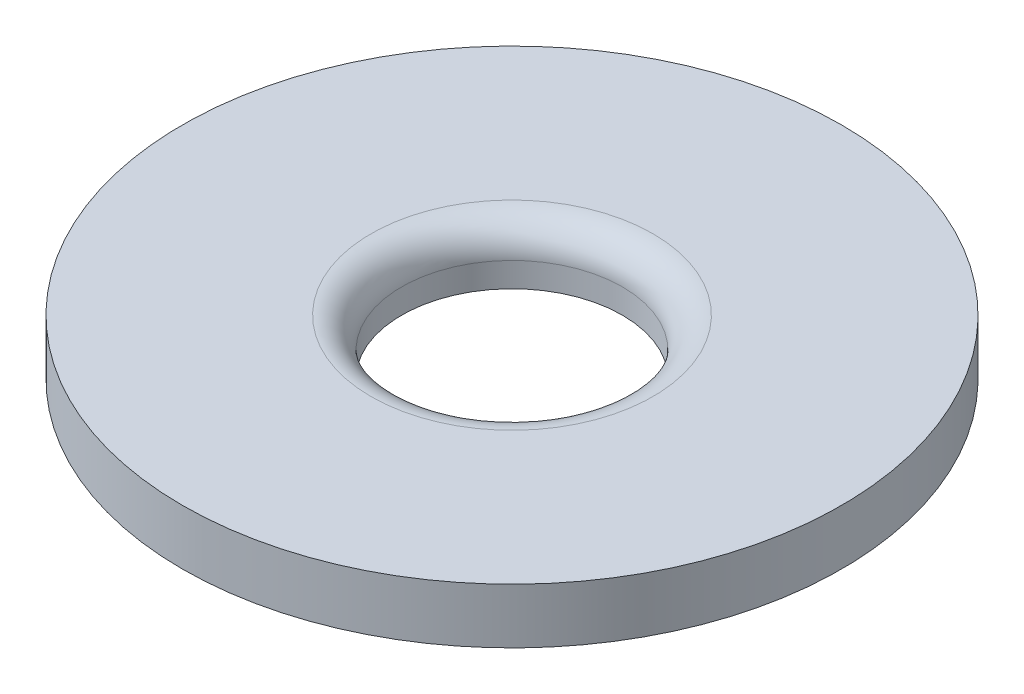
from build123d import *


with BuildPart() as part:
    # Esquisse1 → R_volution1 (revolve)
    with BuildSketch(Plane.XY, mode=Mode.PRIVATE) as r_volution1_sk:
        with BuildLine():
            Line((3.6, -0.3), (10.75, -0.3))
            Line((10.75, -0.3), (10.75, 1.5))
            Line((10.75, 1.5), (4.6, 1.5))
            ThreePointArc((4.6, 1.5), (3.892893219, 1.207106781), (3.6, 0.5))
            Line((3.6, 0.5), (3.6, -0.3))
        make_face()
    revolve(r_volution1_sk.sketch.rotate(Axis((0, 0, 0), (0, 1, 0)), 90), axis=Axis((0, 0, 0), (0, 1, 0)))


solid = part.part
